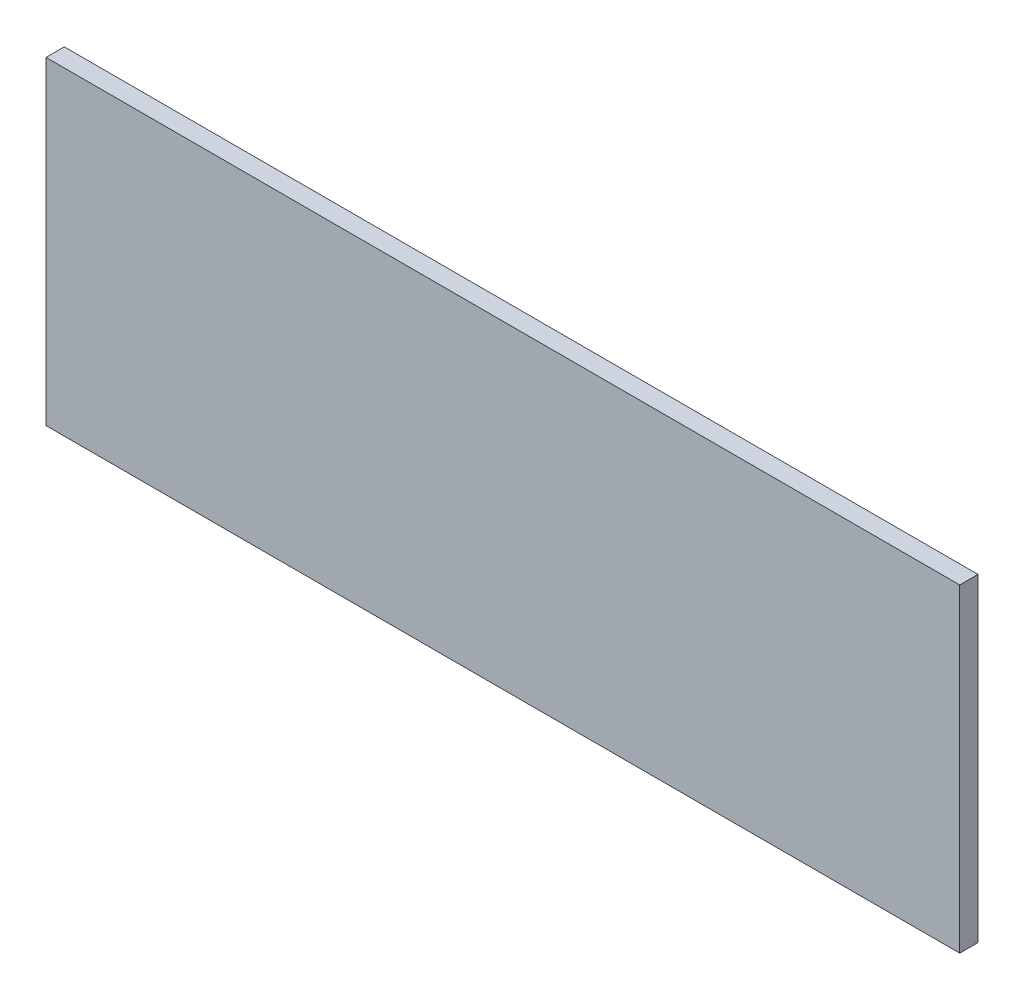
from build123d import *

# Parameters (mm, degrees)
CROQUIS3_W              = 500
CROQUIS3_H              = 174.495448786
SALIENTE_EXTRUIR3_DEPTH = 10


with BuildPart() as part:
    # Croquis3 → Saliente-Extruir3 (new body)
    with BuildSketch(Plane.XY.offset(10)):
        with Locations((-250, 86.39212013)):
            Rectangle(CROQUIS3_W, CROQUIS3_H)
    extrude(amount=-SALIENTE_EXTRUIR3_DEPTH)


solid = part.part
